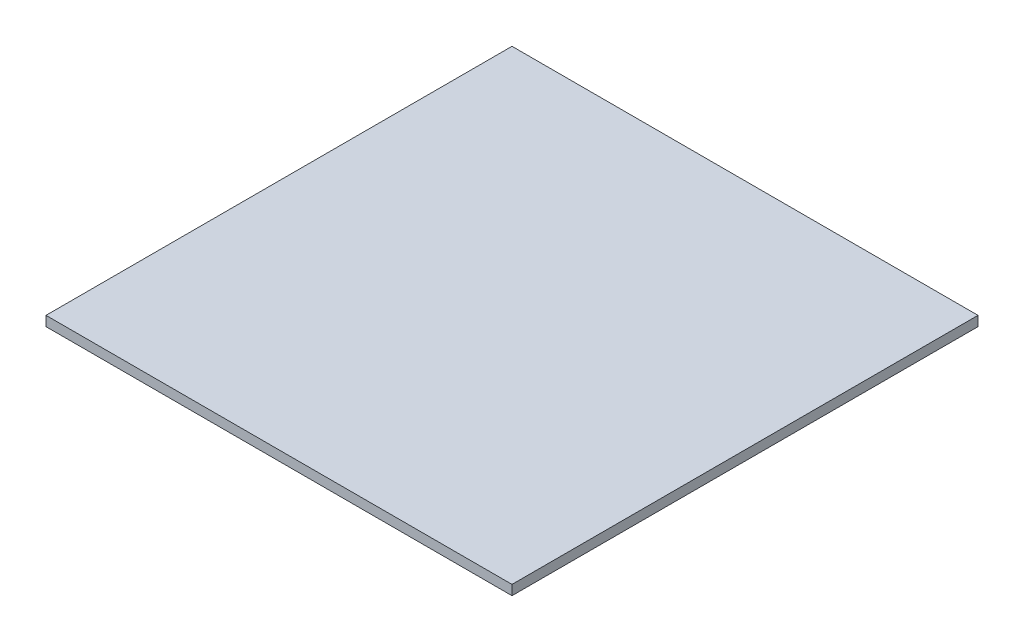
from build123d import *

# Parameters (mm, degrees)
SKETCH1_W           = 95
SKETCH1_H           = 95
BOSS_EXTRUDE1_DEPTH = 2


with BuildPart() as part:
    # Sketch1 → Boss-Extrude1 (new body)
    with BuildSketch(Plane(origin=(0, 0, 0), x_dir=(1, 0, 0), z_dir=(0, 1, 0))):
        Rectangle(SKETCH1_W, SKETCH1_H)
    extrude(amount=BOSS_EXTRUDE1_DEPTH)


solid = part.part
